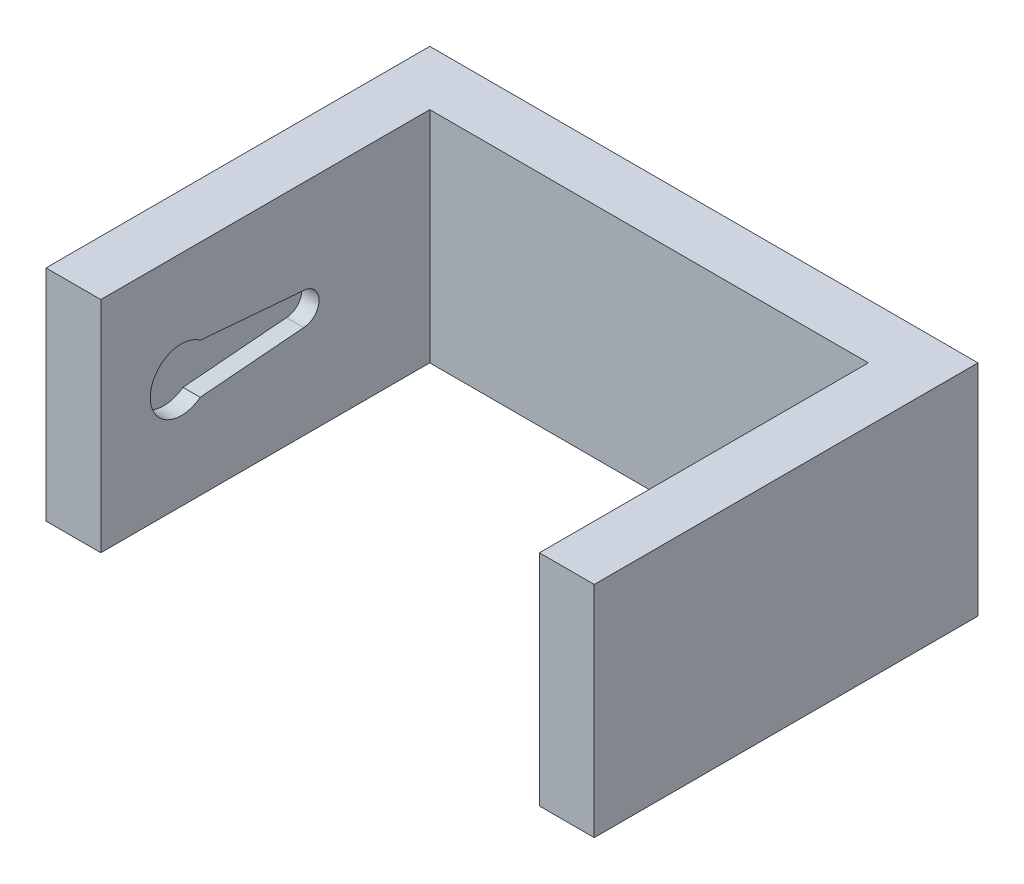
ISO-10303-21;
HEADER;
FILE_DESCRIPTION(('STEP AP214'),'2;1');
FILE_NAME('part.step','',(''),(''),'','','');
FILE_SCHEMA(('AUTOMOTIVE_DESIGN { 1 0 10303 214 1 1 1 1 }'));
ENDSEC;
DATA;
#1=APPLICATION_CONTEXT('core data for automotive mechanical design processes');
#2=APPLICATION_PROTOCOL_DEFINITION('international standard','automotive_design',2000,#1);
#3=PRODUCT_CONTEXT('',#1,'mechanical');
#4=PRODUCT('Part','Part','',(#3));
#5=PRODUCT_RELATED_PRODUCT_CATEGORY('part','',(#4));
#6=PRODUCT_DEFINITION_FORMATION('','',#4);
#7=PRODUCT_DEFINITION_CONTEXT('part definition',#1,'design');
#8=PRODUCT_DEFINITION('design','',#6,#7);
#9=PRODUCT_DEFINITION_SHAPE('','',#8);
#10=(LENGTH_UNIT() NAMED_UNIT(*) SI_UNIT(.MILLI.,.METRE.));
#11=(NAMED_UNIT(*) PLANE_ANGLE_UNIT() SI_UNIT($,.RADIAN.));
#12=(NAMED_UNIT(*) SI_UNIT($,.STERADIAN.) SOLID_ANGLE_UNIT());
#13=UNCERTAINTY_MEASURE_WITH_UNIT(LENGTH_MEASURE(1.E-05),#10,'distance_accuracy_value','');
#14=(GEOMETRIC_REPRESENTATION_CONTEXT(3) GLOBAL_UNCERTAINTY_ASSIGNED_CONTEXT((#13)) GLOBAL_UNIT_ASSIGNED_CONTEXT((#10,
#11,#12)) REPRESENTATION_CONTEXT('',''));
#15=CARTESIAN_POINT('',(0.,0.,0.));
#16=DIRECTION('',(0.,0.,1.));
#17=DIRECTION('',(1.,0.,0.));
#18=AXIS2_PLACEMENT_3D('',#15,#16,#17);
#19=CARTESIAN_POINT('',(-53.1537204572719,3.45383099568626,-4.64883766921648));
#20=DIRECTION('',(1.,0.,0.));
#21=DIRECTION('',(0.,0.,-1.));
#22=AXIS2_PLACEMENT_3D('',#19,#20,#21);
#23=PLANE('',#22);
#24=DIRECTION('',(0.,0.,1.));
#25=VECTOR('',#24,1.);
#26=CARTESIAN_POINT('',(-53.1537204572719,-21.9461690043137,-4.64883766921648));
#27=LINE('',#26,#25);
#28=CARTESIAN_POINT('',(-53.1537204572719,-21.9461690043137,-4.64883766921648));
#29=VERTEX_POINT('',#28);
#30=CARTESIAN_POINT('',(-53.1537204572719,-21.9461690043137,39.8011623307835));
#31=VERTEX_POINT('',#30);
#32=EDGE_CURVE('E152',#29,#31,#27,.T.);
#33=ORIENTED_EDGE('',*,*,#32,.T.);
#34=DIRECTION('',(0.,-1.,0.));
#35=VECTOR('',#34,1.);
#36=CARTESIAN_POINT('',(-53.1537204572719,3.45383099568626,39.8011623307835));
#37=LINE('',#36,#35);
#38=CARTESIAN_POINT('',(-53.1537204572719,3.45383099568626,39.8011623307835));
#39=VERTEX_POINT('',#38);
#40=EDGE_CURVE('E47',#39,#31,#37,.T.);
#41=ORIENTED_EDGE('',*,*,#40,.F.);
#42=DIRECTION('',(0.,0.,1.));
#43=VECTOR('',#42,1.);
#44=CARTESIAN_POINT('',(-53.1537204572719,3.45383099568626,-4.64883766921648));
#45=LINE('',#44,#43);
#46=CARTESIAN_POINT('',(-53.1537204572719,3.45383099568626,-4.64883766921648));
#47=VERTEX_POINT('',#46);
#48=EDGE_CURVE('E105',#47,#39,#45,.T.);
#49=ORIENTED_EDGE('',*,*,#48,.F.);
#50=DIRECTION('',(0.,-1.,0.));
#51=VECTOR('',#50,1.);
#52=CARTESIAN_POINT('',(-53.1537204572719,3.45383099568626,-4.64883766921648));
#53=LINE('',#52,#51);
#54=EDGE_CURVE('E11',#47,#29,#53,.T.);
#55=ORIENTED_EDGE('',*,*,#54,.T.);
#56=EDGE_LOOP('',(#33,#41,#49,#55));
#57=FACE_BOUND('',#56,.T.);
#58=ADVANCED_FACE('F40',(#57),#23,.F.);
#59=CARTESIAN_POINT('',(-53.1537204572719,3.45383099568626,39.8011623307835));
#60=DIRECTION('',(0.,0.,-1.));
#61=DIRECTION('',(-1.,0.,0.));
#62=AXIS2_PLACEMENT_3D('',#59,#60,#61);
#63=PLANE('',#62);
#64=DIRECTION('',(1.,0.,0.));
#65=VECTOR('',#64,1.);
#66=CARTESIAN_POINT('',(-53.1537204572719,-21.9461690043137,39.8011623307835));
#67=LINE('',#66,#65);
#68=CARTESIAN_POINT('',(-46.8037204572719,-21.9461690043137,39.8011623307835));
#69=VERTEX_POINT('',#68);
#70=EDGE_CURVE('E154',#31,#69,#67,.T.);
#71=ORIENTED_EDGE('',*,*,#70,.T.);
#72=DIRECTION('',(0.,-1.,0.));
#73=VECTOR('',#72,1.);
#74=CARTESIAN_POINT('',(-46.8037204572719,3.45383099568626,39.8011623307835));
#75=LINE('',#74,#73);
#76=CARTESIAN_POINT('',(-46.8037204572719,3.45383099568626,39.8011623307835));
#77=VERTEX_POINT('',#76);
#78=EDGE_CURVE('E173',#77,#69,#75,.T.);
#79=ORIENTED_EDGE('',*,*,#78,.F.);
#80=DIRECTION('',(1.,0.,0.));
#81=VECTOR('',#80,1.);
#82=CARTESIAN_POINT('',(-53.1537204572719,3.45383099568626,39.8011623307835));
#83=LINE('',#82,#81);
#84=EDGE_CURVE('E181',#39,#77,#83,.T.);
#85=ORIENTED_EDGE('',*,*,#84,.F.);
#86=ORIENTED_EDGE('',*,*,#40,.T.);
#87=EDGE_LOOP('',(#71,#79,#85,#86));
#88=FACE_BOUND('',#87,.T.);
#89=ADVANCED_FACE('F179',(#88),#63,.F.);
#90=CARTESIAN_POINT('',(-46.8037204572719,3.45383099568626,39.8011623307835));
#91=DIRECTION('',(-1.,0.,0.));
#92=DIRECTION('',(0.,0.,1.));
#93=AXIS2_PLACEMENT_3D('',#90,#91,#92);
#94=PLANE('',#93);
#95=DIRECTION('',(0.,0.0828458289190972,-0.996562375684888));
#96=VECTOR('',#95,1.);
#97=CARTESIAN_POINT('',(-46.8037204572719,-12.1059796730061,28.2900590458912));
#98=LINE('',#97,#96);
#99=CARTESIAN_POINT('',(-46.8037204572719,-12.1059796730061,28.2900590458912));
#100=VERTEX_POINT('',#99);
#101=CARTESIAN_POINT('',(-46.8037204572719,-11.1090431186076,16.2977901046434));
#102=VERTEX_POINT('',#101);
#103=EDGE_CURVE('E217',#100,#102,#98,.T.);
#104=ORIENTED_EDGE('',*,*,#103,.F.);
#105=CARTESIAN_POINT('',(-46.8037204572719,-9.2461690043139,30.4767192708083));
#106=DIRECTION('',(1.,0.,0.));
#107=DIRECTION('',(0.,0.,-1.));
#108=AXIS2_PLACEMENT_3D('',#105,#106,#107);
#109=CIRCLE('',#108,3.6);
#110=CARTESIAN_POINT('',(-46.8037204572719,-6.38635833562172,28.2900590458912));
#111=VERTEX_POINT('',#110);
#112=EDGE_CURVE('E54',#111,#100,#109,.T.);
#113=ORIENTED_EDGE('',*,*,#112,.F.);
#114=DIRECTION('',(0.,0.0828458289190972,0.996562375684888));
#115=VECTOR('',#114,1.);
#116=CARTESIAN_POINT('',(-46.8037204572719,-6.38635833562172,28.2900590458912));
#117=LINE('',#116,#115);
#118=CARTESIAN_POINT('',(-46.8037204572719,-7.38329489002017,16.2977901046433));
#119=VERTEX_POINT('',#118);
#120=EDGE_CURVE('E210',#119,#111,#117,.T.);
#121=ORIENTED_EDGE('',*,*,#120,.F.);
#122=CARTESIAN_POINT('',(-46.8037204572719,-9.2461690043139,16.3874355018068));
#123=DIRECTION('',(1.,0.,0.));
#124=DIRECTION('',(0.,0.,1.));
#125=AXIS2_PLACEMENT_3D('',#122,#123,#124);
#126=CIRCLE('',#125,1.86502982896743);
#127=EDGE_CURVE('E214',#102,#119,#126,.T.);
#128=ORIENTED_EDGE('',*,*,#127,.F.);
#129=EDGE_LOOP('',(#104,#113,#121,#128));
#130=FACE_BOUND('',#129,.T.);
#131=DIRECTION('',(0.,0.,-1.));
#132=VECTOR('',#131,1.);
#133=CARTESIAN_POINT('',(-46.8037204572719,-21.9461690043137,39.8011623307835));
#134=LINE('',#133,#132);
#135=CARTESIAN_POINT('',(-46.8037204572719,-21.9461690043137,1.70116233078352));
#136=VERTEX_POINT('',#135);
#137=EDGE_CURVE('E157',#69,#136,#134,.T.);
#138=ORIENTED_EDGE('',*,*,#137,.T.);
#139=DIRECTION('',(0.,-1.,0.));
#140=VECTOR('',#139,1.);
#141=CARTESIAN_POINT('',(-46.8037204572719,3.45383099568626,1.70116233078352));
#142=LINE('',#141,#140);
#143=CARTESIAN_POINT('',(-46.8037204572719,3.45383099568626,1.70116233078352));
#144=VERTEX_POINT('',#143);
#145=EDGE_CURVE('E170',#144,#136,#142,.T.);
#146=ORIENTED_EDGE('',*,*,#145,.F.);
#147=DIRECTION('',(0.,0.,-1.));
#148=VECTOR('',#147,1.);
#149=CARTESIAN_POINT('',(-46.8037204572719,3.45383099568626,39.8011623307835));
#150=LINE('',#149,#148);
#151=EDGE_CURVE('E194',#77,#144,#150,.T.);
#152=ORIENTED_EDGE('',*,*,#151,.F.);
#153=ORIENTED_EDGE('',*,*,#78,.T.);
#154=EDGE_LOOP('',(#138,#146,#152,#153));
#155=FACE_BOUND('',#154,.T.);
#156=ADVANCED_FACE('F190',(#130,#155),#94,.F.);
#157=CARTESIAN_POINT('',(-46.8037204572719,3.45383099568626,1.70116233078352));
#158=DIRECTION('',(0.,0.,-1.));
#159=DIRECTION('',(-1.,0.,0.));
#160=AXIS2_PLACEMENT_3D('',#157,#158,#159);
#161=PLANE('',#160);
#162=DIRECTION('',(1.,0.,0.));
#163=VECTOR('',#162,1.);
#164=CARTESIAN_POINT('',(-46.8037204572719,-21.9461690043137,1.70116233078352));
#165=LINE('',#164,#163);
#166=CARTESIAN_POINT('',(3.9962795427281,-21.9461690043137,1.70116233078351));
#167=VERTEX_POINT('',#166);
#168=EDGE_CURVE('E159',#136,#167,#165,.T.);
#169=ORIENTED_EDGE('',*,*,#168,.T.);
#170=DIRECTION('',(0.,-1.,0.));
#171=VECTOR('',#170,1.);
#172=CARTESIAN_POINT('',(3.9962795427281,3.45383099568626,1.70116233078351));
#173=LINE('',#172,#171);
#174=CARTESIAN_POINT('',(3.9962795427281,3.45383099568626,1.70116233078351));
#175=VERTEX_POINT('',#174);
#176=EDGE_CURVE('E141',#175,#167,#173,.T.);
#177=ORIENTED_EDGE('',*,*,#176,.F.);
#178=DIRECTION('',(1.,0.,0.));
#179=VECTOR('',#178,1.);
#180=CARTESIAN_POINT('',(-46.8037204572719,3.45383099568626,1.70116233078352));
#181=LINE('',#180,#179);
#182=EDGE_CURVE('E129',#144,#175,#181,.T.);
#183=ORIENTED_EDGE('',*,*,#182,.F.);
#184=ORIENTED_EDGE('',*,*,#145,.T.);
#185=EDGE_LOOP('',(#169,#177,#183,#184));
#186=FACE_BOUND('',#185,.T.);
#187=ADVANCED_FACE('F193',(#186),#161,.F.);
#188=CARTESIAN_POINT('',(3.9962795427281,3.45383099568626,39.8011623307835));
#189=DIRECTION('',(1.,0.,0.));
#190=DIRECTION('',(0.,0.,-1.));
#191=AXIS2_PLACEMENT_3D('',#188,#189,#190);
#192=PLANE('',#191);
#193=DIRECTION('',(0.,0.,1.));
#194=VECTOR('',#193,1.);
#195=CARTESIAN_POINT('',(3.9962795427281,-21.9461690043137,39.8011623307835));
#196=LINE('',#195,#194);
#197=CARTESIAN_POINT('',(3.9962795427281,-21.9461690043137,39.8011623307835));
#198=VERTEX_POINT('',#197);
#199=EDGE_CURVE('E138',#167,#198,#196,.T.);
#200=ORIENTED_EDGE('',*,*,#199,.T.);
#201=DIRECTION('',(0.,-1.,0.));
#202=VECTOR('',#201,1.);
#203=CARTESIAN_POINT('',(3.9962795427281,3.45383099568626,39.8011623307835));
#204=LINE('',#203,#202);
#205=CARTESIAN_POINT('',(3.9962795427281,3.45383099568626,39.8011623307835));
#206=VERTEX_POINT('',#205);
#207=EDGE_CURVE('E135',#206,#198,#204,.T.);
#208=ORIENTED_EDGE('',*,*,#207,.F.);
#209=DIRECTION('',(0.,0.,1.));
#210=VECTOR('',#209,1.);
#211=CARTESIAN_POINT('',(3.9962795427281,3.45383099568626,39.8011623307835));
#212=LINE('',#211,#210);
#213=EDGE_CURVE('E122',#175,#206,#212,.T.);
#214=ORIENTED_EDGE('',*,*,#213,.F.);
#215=ORIENTED_EDGE('',*,*,#176,.T.);
#216=EDGE_LOOP('',(#200,#208,#214,#215));
#217=FACE_BOUND('',#216,.T.);
#218=ADVANCED_FACE('F136',(#217),#192,.F.);
#219=CARTESIAN_POINT('',(10.3462795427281,3.45383099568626,39.8011623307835));
#220=DIRECTION('',(0.,0.,-1.));
#221=DIRECTION('',(-1.,0.,0.));
#222=AXIS2_PLACEMENT_3D('',#219,#220,#221);
#223=PLANE('',#222);
#224=DIRECTION('',(1.,0.,0.));
#225=VECTOR('',#224,1.);
#226=CARTESIAN_POINT('',(10.3462795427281,-21.9461690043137,39.8011623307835));
#227=LINE('',#226,#225);
#228=CARTESIAN_POINT('',(10.3462795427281,-21.9461690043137,39.8011623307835));
#229=VERTEX_POINT('',#228);
#230=EDGE_CURVE('E162',#198,#229,#227,.T.);
#231=ORIENTED_EDGE('',*,*,#230,.T.);
#232=DIRECTION('',(0.,-1.,0.));
#233=VECTOR('',#232,1.);
#234=CARTESIAN_POINT('',(10.3462795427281,3.45383099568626,39.8011623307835));
#235=LINE('',#234,#233);
#236=CARTESIAN_POINT('',(10.3462795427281,3.45383099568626,39.8011623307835));
#237=VERTEX_POINT('',#236);
#238=EDGE_CURVE('E142',#237,#229,#235,.T.);
#239=ORIENTED_EDGE('',*,*,#238,.F.);
#240=DIRECTION('',(1.,0.,0.));
#241=VECTOR('',#240,1.);
#242=CARTESIAN_POINT('',(10.3462795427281,3.45383099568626,39.8011623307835));
#243=LINE('',#242,#241);
#244=EDGE_CURVE('E126',#206,#237,#243,.T.);
#245=ORIENTED_EDGE('',*,*,#244,.F.);
#246=ORIENTED_EDGE('',*,*,#207,.T.);
#247=EDGE_LOOP('',(#231,#239,#245,#246));
#248=FACE_BOUND('',#247,.T.);
#249=ADVANCED_FACE('F144',(#248),#223,.F.);
#250=CARTESIAN_POINT('',(10.3462795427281,3.45383099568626,-4.64883766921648));
#251=DIRECTION('',(-1.,0.,0.));
#252=DIRECTION('',(0.,0.,1.));
#253=AXIS2_PLACEMENT_3D('',#250,#251,#252);
#254=PLANE('',#253);
#255=DIRECTION('',(0.,0.,-1.));
#256=VECTOR('',#255,1.);
#257=CARTESIAN_POINT('',(10.3462795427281,-21.9461690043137,-4.64883766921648));
#258=LINE('',#257,#256);
#259=CARTESIAN_POINT('',(10.3462795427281,-21.9461690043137,-4.64883766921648));
#260=VERTEX_POINT('',#259);
#261=EDGE_CURVE('E98',#229,#260,#258,.T.);
#262=ORIENTED_EDGE('',*,*,#261,.T.);
#263=DIRECTION('',(0.,-1.,0.));
#264=VECTOR('',#263,1.);
#265=CARTESIAN_POINT('',(10.3462795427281,3.45383099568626,-4.64883766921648));
#266=LINE('',#265,#264);
#267=CARTESIAN_POINT('',(10.3462795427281,3.45383099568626,-4.64883766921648));
#268=VERTEX_POINT('',#267);
#269=EDGE_CURVE('E148',#268,#260,#266,.T.);
#270=ORIENTED_EDGE('',*,*,#269,.F.);
#271=DIRECTION('',(0.,0.,-1.));
#272=VECTOR('',#271,1.);
#273=CARTESIAN_POINT('',(10.3462795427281,3.45383099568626,-4.64883766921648));
#274=LINE('',#273,#272);
#275=EDGE_CURVE('E146',#237,#268,#274,.T.);
#276=ORIENTED_EDGE('',*,*,#275,.F.);
#277=ORIENTED_EDGE('',*,*,#238,.T.);
#278=EDGE_LOOP('',(#262,#270,#276,#277));
#279=FACE_BOUND('',#278,.T.);
#280=ADVANCED_FACE('F274',(#279),#254,.F.);
#281=CARTESIAN_POINT('',(-21.4037204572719,3.45383099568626,-4.64883766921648));
#282=DIRECTION('',(0.,0.,1.));
#283=DIRECTION('',(1.,0.,0.));
#284=AXIS2_PLACEMENT_3D('',#281,#282,#283);
#285=PLANE('',#284);
#286=DIRECTION('',(-1.,0.,0.));
#287=VECTOR('',#286,1.);
#288=CARTESIAN_POINT('',(-21.4037204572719,-21.9461690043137,-4.64883766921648));
#289=LINE('',#288,#287);
#290=EDGE_CURVE('E165',#260,#29,#289,.T.);
#291=ORIENTED_EDGE('',*,*,#290,.T.);
#292=ORIENTED_EDGE('',*,*,#54,.F.);
#293=DIRECTION('',(-1.,0.,0.));
#294=VECTOR('',#293,1.);
#295=CARTESIAN_POINT('',(-21.4037204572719,3.45383099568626,-4.64883766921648));
#296=LINE('',#295,#294);
#297=EDGE_CURVE('E63',#268,#47,#296,.T.);
#298=ORIENTED_EDGE('',*,*,#297,.F.);
#299=ORIENTED_EDGE('',*,*,#269,.T.);
#300=EDGE_LOOP('',(#291,#292,#298,#299));
#301=FACE_BOUND('',#300,.T.);
#302=ADVANCED_FACE('F273',(#301),#285,.F.);
#303=CARTESIAN_POINT('',(-21.4037204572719,3.45383099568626,1.70116233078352));
#304=DIRECTION('',(0.,1.,0.));
#305=DIRECTION('',(0.,0.,1.));
#306=AXIS2_PLACEMENT_3D('',#303,#304,#305);
#307=PLANE('',#306);
#308=ORIENTED_EDGE('',*,*,#297,.T.);
#309=ORIENTED_EDGE('',*,*,#48,.T.);
#310=ORIENTED_EDGE('',*,*,#84,.T.);
#311=ORIENTED_EDGE('',*,*,#151,.T.);
#312=ORIENTED_EDGE('',*,*,#182,.T.);
#313=ORIENTED_EDGE('',*,*,#213,.T.);
#314=ORIENTED_EDGE('',*,*,#244,.T.);
#315=ORIENTED_EDGE('',*,*,#275,.T.);
#316=EDGE_LOOP('',(#308,#309,#310,#311,#312,#313,#314,#315));
#317=FACE_BOUND('',#316,.T.);
#318=ADVANCED_FACE('F124',(#317),#307,.T.);
#319=CARTESIAN_POINT('',(-21.4037204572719,-21.9461690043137,1.70116233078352));
#320=DIRECTION('',(0.,1.,0.));
#321=DIRECTION('',(0.,0.,1.));
#322=AXIS2_PLACEMENT_3D('',#319,#320,#321);
#323=PLANE('',#322);
#324=ORIENTED_EDGE('',*,*,#32,.F.);
#325=ORIENTED_EDGE('',*,*,#290,.F.);
#326=ORIENTED_EDGE('',*,*,#261,.F.);
#327=ORIENTED_EDGE('',*,*,#230,.F.);
#328=ORIENTED_EDGE('',*,*,#199,.F.);
#329=ORIENTED_EDGE('',*,*,#168,.F.);
#330=ORIENTED_EDGE('',*,*,#137,.F.);
#331=ORIENTED_EDGE('',*,*,#70,.F.);
#332=EDGE_LOOP('',(#324,#325,#326,#327,#328,#329,#330,#331));
#333=FACE_BOUND('',#332,.T.);
#334=ADVANCED_FACE('F185',(#333),#323,.F.);
#335=CARTESIAN_POINT('',(-48.8037204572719,-9.2461690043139,30.4767192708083));
#336=DIRECTION('',(1.,0.,0.));
#337=DIRECTION('',(0.,0.,-1.));
#338=AXIS2_PLACEMENT_3D('',#335,#336,#337);
#339=CYLINDRICAL_SURFACE('',#338,3.6);
#340=ORIENTED_EDGE('',*,*,#112,.T.);
#341=DIRECTION('',(1.,0.,0.));
#342=VECTOR('',#341,1.);
#343=CARTESIAN_POINT('',(-48.8037204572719,-12.1059796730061,28.2900590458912));
#344=LINE('',#343,#342);
#345=CARTESIAN_POINT('',(-48.8037204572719,-12.1059796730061,28.2900590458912));
#346=VERTEX_POINT('',#345);
#347=EDGE_CURVE('E200',#346,#100,#344,.T.);
#348=ORIENTED_EDGE('',*,*,#347,.F.);
#349=CARTESIAN_POINT('',(-48.8037204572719,-9.2461690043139,30.4767192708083));
#350=DIRECTION('',(1.,0.,0.));
#351=DIRECTION('',(0.,0.,-1.));
#352=AXIS2_PLACEMENT_3D('',#349,#350,#351);
#353=CIRCLE('',#352,3.6);
#354=CARTESIAN_POINT('',(-48.8037204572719,-6.38635833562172,28.2900590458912));
#355=VERTEX_POINT('',#354);
#356=EDGE_CURVE('E213',#355,#346,#353,.T.);
#357=ORIENTED_EDGE('',*,*,#356,.F.);
#358=DIRECTION('',(1.,0.,0.));
#359=VECTOR('',#358,1.);
#360=CARTESIAN_POINT('',(-48.8037204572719,-6.38635833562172,28.2900590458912));
#361=LINE('',#360,#359);
#362=EDGE_CURVE('E155',#355,#111,#361,.T.);
#363=ORIENTED_EDGE('',*,*,#362,.T.);
#364=EDGE_LOOP('',(#340,#348,#357,#363));
#365=FACE_BOUND('',#364,.T.);
#366=ADVANCED_FACE('F238',(#365),#339,.F.);
#367=CARTESIAN_POINT('',(-48.8037204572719,-6.38635833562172,28.2900590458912));
#368=DIRECTION('',(0.,0.996562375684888,-0.0828458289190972));
#369=DIRECTION('',(0.,0.0828458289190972,0.996562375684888));
#370=AXIS2_PLACEMENT_3D('',#367,#368,#369);
#371=PLANE('',#370);
#372=ORIENTED_EDGE('',*,*,#120,.T.);
#373=ORIENTED_EDGE('',*,*,#362,.F.);
#374=DIRECTION('',(0.,0.0828458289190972,0.996562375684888));
#375=VECTOR('',#374,1.);
#376=CARTESIAN_POINT('',(-48.8037204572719,-6.38635833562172,28.2900590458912));
#377=LINE('',#376,#375);
#378=CARTESIAN_POINT('',(-48.8037204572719,-7.38329489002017,16.2977901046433));
#379=VERTEX_POINT('',#378);
#380=EDGE_CURVE('E203',#379,#355,#377,.T.);
#381=ORIENTED_EDGE('',*,*,#380,.F.);
#382=DIRECTION('',(1.,0.,0.));
#383=VECTOR('',#382,1.);
#384=CARTESIAN_POINT('',(-48.8037204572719,-7.38329489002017,16.2977901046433));
#385=LINE('',#384,#383);
#386=EDGE_CURVE('E206',#379,#119,#385,.T.);
#387=ORIENTED_EDGE('',*,*,#386,.T.);
#388=EDGE_LOOP('',(#372,#373,#381,#387));
#389=FACE_BOUND('',#388,.T.);
#390=ADVANCED_FACE('F249',(#389),#371,.F.);
#391=CARTESIAN_POINT('',(-48.8037204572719,-9.2461690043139,16.3874355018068));
#392=DIRECTION('',(1.,0.,0.));
#393=DIRECTION('',(0.,0.,-1.));
#394=AXIS2_PLACEMENT_3D('',#391,#392,#393);
#395=CYLINDRICAL_SURFACE('',#394,1.86502982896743);
#396=ORIENTED_EDGE('',*,*,#127,.T.);
#397=ORIENTED_EDGE('',*,*,#386,.F.);
#398=CARTESIAN_POINT('',(-48.8037204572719,-9.2461690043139,16.3874355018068));
#399=DIRECTION('',(1.,0.,0.));
#400=DIRECTION('',(0.,0.,1.));
#401=AXIS2_PLACEMENT_3D('',#398,#399,#400);
#402=CIRCLE('',#401,1.86502982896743);
#403=CARTESIAN_POINT('',(-48.8037204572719,-11.1090431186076,16.2977901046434));
#404=VERTEX_POINT('',#403);
#405=EDGE_CURVE('E223',#404,#379,#402,.T.);
#406=ORIENTED_EDGE('',*,*,#405,.F.);
#407=DIRECTION('',(1.,0.,0.));
#408=VECTOR('',#407,1.);
#409=CARTESIAN_POINT('',(-48.8037204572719,-11.1090431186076,16.2977901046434));
#410=LINE('',#409,#408);
#411=EDGE_CURVE('E202',#404,#102,#410,.T.);
#412=ORIENTED_EDGE('',*,*,#411,.T.);
#413=EDGE_LOOP('',(#396,#397,#406,#412));
#414=FACE_BOUND('',#413,.T.);
#415=ADVANCED_FACE('F254',(#414),#395,.F.);
#416=CARTESIAN_POINT('',(-48.8037204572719,-12.1059796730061,28.2900590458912));
#417=DIRECTION('',(0.,-0.996562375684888,-0.0828458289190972));
#418=DIRECTION('',(0.,0.0828458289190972,-0.996562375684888));
#419=AXIS2_PLACEMENT_3D('',#416,#417,#418);
#420=PLANE('',#419);
#421=ORIENTED_EDGE('',*,*,#103,.T.);
#422=ORIENTED_EDGE('',*,*,#411,.F.);
#423=DIRECTION('',(0.,0.0828458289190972,-0.996562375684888));
#424=VECTOR('',#423,1.);
#425=CARTESIAN_POINT('',(-48.8037204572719,-12.1059796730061,28.2900590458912));
#426=LINE('',#425,#424);
#427=EDGE_CURVE('E226',#346,#404,#426,.T.);
#428=ORIENTED_EDGE('',*,*,#427,.F.);
#429=ORIENTED_EDGE('',*,*,#347,.T.);
#430=EDGE_LOOP('',(#421,#422,#428,#429));
#431=FACE_BOUND('',#430,.T.);
#432=ADVANCED_FACE('F259',(#431),#420,.F.);
#433=CARTESIAN_POINT('',(-48.8037204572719,-9.2461690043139,30.4767192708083));
#434=DIRECTION('',(1.,0.,0.));
#435=DIRECTION('',(0.,0.,-1.));
#436=AXIS2_PLACEMENT_3D('',#433,#434,#435);
#437=PLANE('',#436);
#438=ORIENTED_EDGE('',*,*,#356,.T.);
#439=ORIENTED_EDGE('',*,*,#427,.T.);
#440=ORIENTED_EDGE('',*,*,#405,.T.);
#441=ORIENTED_EDGE('',*,*,#380,.T.);
#442=EDGE_LOOP('',(#438,#439,#440,#441));
#443=FACE_BOUND('',#442,.T.);
#444=ADVANCED_FACE('F233',(#443),#437,.T.);
#445=CLOSED_SHELL('',(#58,#89,#156,#187,#218,#249,#280,#302,#318,#334,#366,#390,#415,#432,#444));
#446=MANIFOLD_SOLID_BREP('B2',#445);
#447=ADVANCED_BREP_SHAPE_REPRESENTATION('',(#18,#446),#14);
#448=SHAPE_DEFINITION_REPRESENTATION(#9,#447);
ENDSEC;
END-ISO-10303-21;
